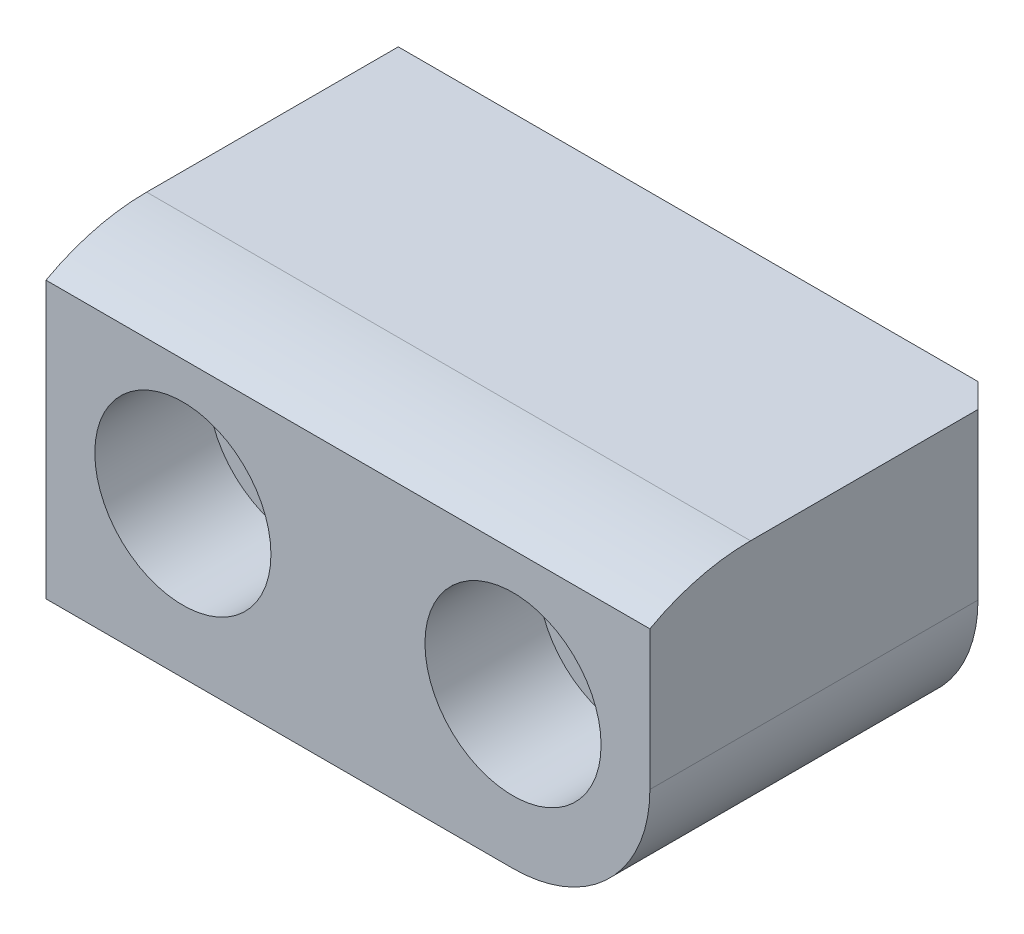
from build123d import *

# Parameters (mm, degrees)
SKETCH3_W                  = 38.1
SKETCH3_H                  = 19.05
EXTRUDE1_DEPTH             = 22.225
FILLET1_R                  = 8.636
F_1_4_20_CBORE_D           = 6.5278
F_1_4_20_CBORE_CBORE_D     = 11.1125
F_1_4_20_CBORE_CBORE_DEPTH = 7.14375
CUT_EXTRUDE1_DEPTH         = 49.046468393
CHAMFER1_SIZE              = 1.524


with BuildPart() as part:
    # Sketch3 → Extrude1 (new body)
    with BuildSketch(Plane.XY):
        with Locations((19.05, -9.525)):
            Rectangle(SKETCH3_W, SKETCH3_H)
    extrude(amount=-EXTRUDE1_DEPTH)

    # Fillet1
    fillet1_edges = [part.edges().sort_by_distance(p)[0] for p in [
        (38.1, -19.05, -11.1125),
    ]]
    fillet(fillet1_edges, radius=FILLET1_R)

    # 1_4_-20 CBORE (through all)
    with Locations(Plane.XY):
        with Locations((8.636, -9.525), (29.464, -9.525)):
            CounterBoreHole(F_1_4_20_CBORE_D / 2, F_1_4_20_CBORE_CBORE_D / 2, F_1_4_20_CBORE_CBORE_DEPTH)

    # Sketch6 → Cut-Extrude1 (cut, through all)
    with BuildSketch(Plane.ZY):
        with BuildLine():
            Line((-6.35, 0), (-6.35, 5.08))
            Line((-6.35, 5.08), (6.35, 5.08))
            Line((6.35, 5.08), (6.35, -1.636637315))
            Line((6.35, -1.636637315), (0, -1.636637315))
            ThreePointArc((0, -1.636637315), (-3.071239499, -0.415737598), (-6.35, 0))
        make_face()
    extrude(amount=-CUT_EXTRUDE1_DEPTH, mode=Mode.SUBTRACT)

    # Chamfer1
    chamfer1_edges = [part.edges().sort_by_distance(p)[0] for p in [
        (38.1, -5.207, -22.225),
        (35.570574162, -16.520574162, -22.225),
        (14.732, -19.05, -22.225),
    ]]
    chamfer(chamfer1_edges, length=CHAMFER1_SIZE)


solid = part.part
